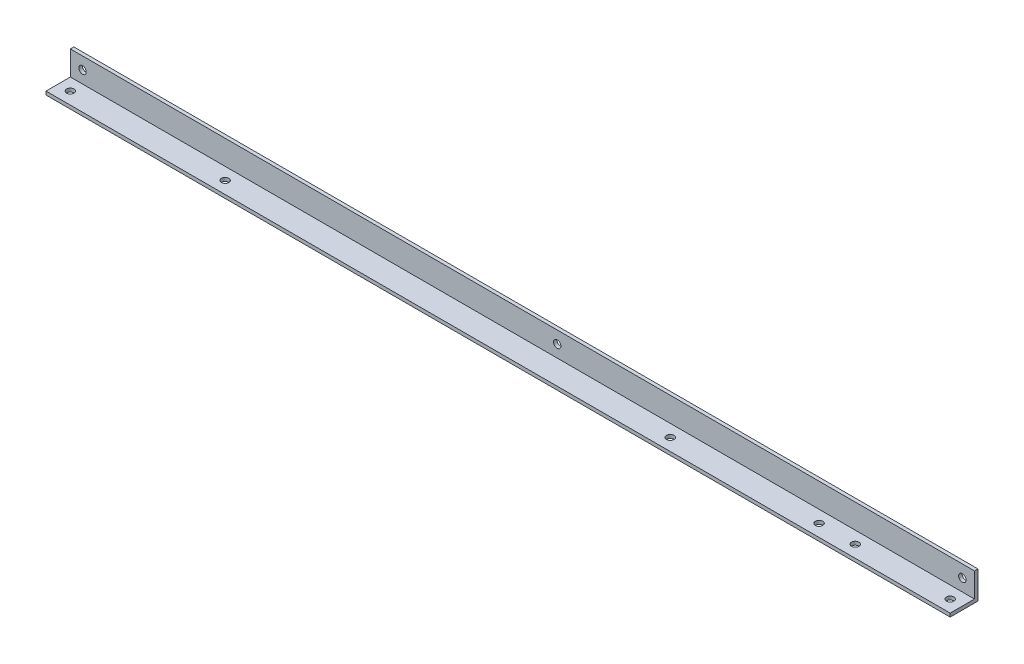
from build123d import *

# Parameters (mm, degrees)
SKETCH1_W           = 825.5
SKETCH1_H           = 25.4
BOSS_EXTRUDE1_DEPTH = 3.175
SKETCH2_W           = 825.5
SKETCH2_H           = 3.175
BOSS_EXTRUDE2_DEPTH = 22.225
SKETCH3_R           = 3.3782
CUT_EXTRUDE1_DEPTH  = 414.542988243
SKETCH4_R           = 3.3782
CUT_EXTRUDE2_DEPTH  = 415.127604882


with BuildPart() as part:
    # Sketch1 → Boss-Extrude1 (new body)
    with BuildSketch(Plane(origin=(0, 0, 0), x_dir=(1, 0, 0), z_dir=(0, 1, 0))):
        Rectangle(SKETCH1_W, SKETCH1_H)
    extrude(amount=BOSS_EXTRUDE1_DEPTH)

    # Sketch2 → Boss-Extrude2 (add)
    with BuildSketch(Plane(origin=(0, 3.175, 0), x_dir=(1, 0, 0), z_dir=(0, 1, 0))):
        with Locations((0, 11.1125)):
            Rectangle(SKETCH2_W, SKETCH2_H)
    extrude(amount=BOSS_EXTRUDE2_DEPTH)

    # Sketch3 → Cut-Extrude1 (cut, through all)
    with BuildSketch(Plane(origin=(0, 3.175, 0), x_dir=(1, 0, 0), z_dir=(0, 1, 0))):
        with Locations(Location((-401.6375, -1.5875, 0), (0, 0, 270))):
            Circle(SKETCH3_R)
        with Locations(Location((-260.35, -1.5875, 0), (0, 0, 270))):
            Circle(SKETCH3_R)
        with Locations(Location((401.6375, -1.5875, 0), (0, 0, 270))):
            Circle(SKETCH3_R)
        with Locations(Location((314.96, -1.5875, 0), (0, 0, 270))):
            Circle(SKETCH3_R)
        with Locations(Location((146.05, -1.5875, 0), (0, 0, 270))):
            Circle(SKETCH3_R)
        with Locations(Location((281.94, -1.5875, 0), (0, 0, 270))):
            Circle(SKETCH3_R)
    extrude(amount=-CUT_EXTRUDE1_DEPTH, mode=Mode.SUBTRACT)

    # Sketch4 → Cut-Extrude2 (cut, through all)
    with BuildSketch(Plane.XY.offset(-9.525)):
        with Locations((-401.6375, 14.2875)):
            Circle(SKETCH4_R)
        with Locations((401.6375, 14.2875)):
            Circle(SKETCH4_R)
        with Locations((31.75, 14.2875)):
            Circle(SKETCH4_R)
    extrude(amount=-CUT_EXTRUDE2_DEPTH, mode=Mode.SUBTRACT)


solid = part.part
